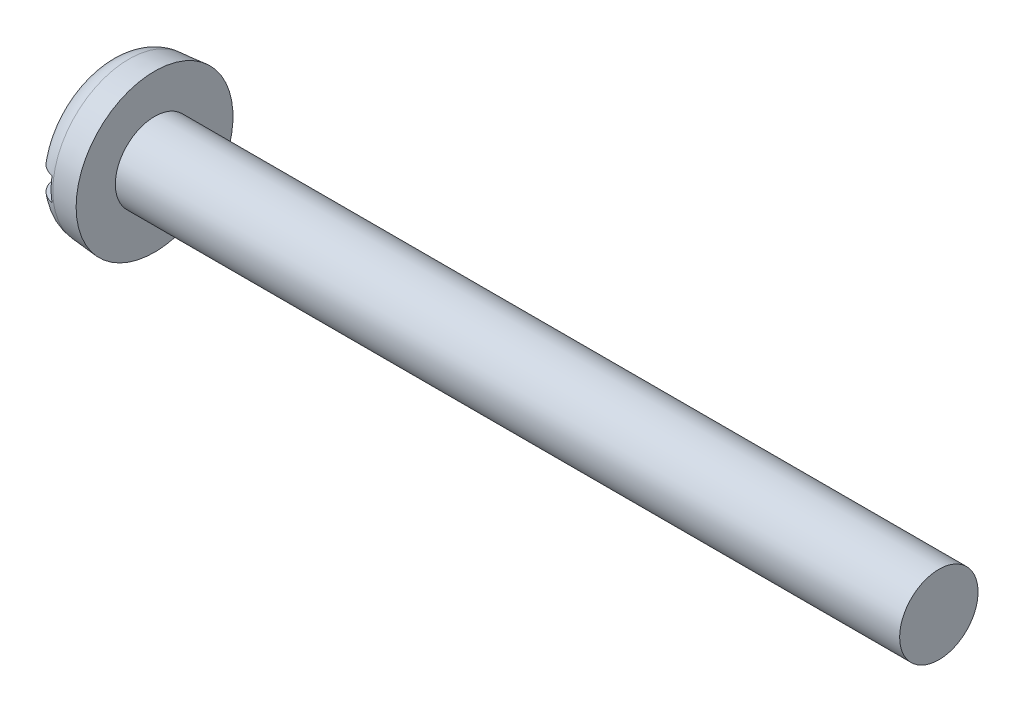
ISO-10303-21;
HEADER;
FILE_DESCRIPTION(('STEP AP214'),'2;1');
FILE_NAME('part.step','',(''),(''),'','','');
FILE_SCHEMA(('AUTOMOTIVE_DESIGN { 1 0 10303 214 1 1 1 1 }'));
ENDSEC;
DATA;
#1=APPLICATION_CONTEXT('core data for automotive mechanical design processes');
#2=APPLICATION_PROTOCOL_DEFINITION('international standard','automotive_design',2000,#1);
#3=PRODUCT_CONTEXT('',#1,'mechanical');
#4=PRODUCT('Part','Part','',(#3));
#5=PRODUCT_RELATED_PRODUCT_CATEGORY('part','',(#4));
#6=PRODUCT_DEFINITION_FORMATION('','',#4);
#7=PRODUCT_DEFINITION_CONTEXT('part definition',#1,'design');
#8=PRODUCT_DEFINITION('design','',#6,#7);
#9=PRODUCT_DEFINITION_SHAPE('','',#8);
#10=(LENGTH_UNIT() NAMED_UNIT(*) SI_UNIT(.MILLI.,.METRE.));
#11=(NAMED_UNIT(*) PLANE_ANGLE_UNIT() SI_UNIT($,.RADIAN.));
#12=(NAMED_UNIT(*) SI_UNIT($,.STERADIAN.) SOLID_ANGLE_UNIT());
#13=UNCERTAINTY_MEASURE_WITH_UNIT(LENGTH_MEASURE(1.E-05),#10,'distance_accuracy_value','');
#14=(GEOMETRIC_REPRESENTATION_CONTEXT(3) GLOBAL_UNCERTAINTY_ASSIGNED_CONTEXT((#13)) GLOBAL_UNIT_ASSIGNED_CONTEXT((#10,
#11,#12)) REPRESENTATION_CONTEXT('',''));
#15=CARTESIAN_POINT('',(0.,0.,0.));
#16=DIRECTION('',(0.,0.,1.));
#17=DIRECTION('',(1.,0.,0.));
#18=AXIS2_PLACEMENT_3D('',#15,#16,#17);
#19=CARTESIAN_POINT('',(0.,0.,0.));
#20=DIRECTION('',(-1.,0.,0.));
#21=DIRECTION('',(0.,0.,1.));
#22=AXIS2_PLACEMENT_3D('',#19,#20,#21);
#23=PLANE('',#22);
#24=DIRECTION('',(0.,0.,-1.));
#25=VECTOR('',#24,1.);
#26=CARTESIAN_POINT('',(0.,0.599999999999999,4.));
#27=LINE('',#26,#25);
#28=CARTESIAN_POINT('',(0.,0.599999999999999,2.62267277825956));
#29=VERTEX_POINT('',#28);
#30=CARTESIAN_POINT('',(0.,0.599999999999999,-2.62267277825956));
#31=VERTEX_POINT('',#30);
#32=EDGE_CURVE('E86',#29,#31,#27,.T.);
#33=ORIENTED_EDGE('',*,*,#32,.F.);
#34=CARTESIAN_POINT('',(0.,0.,0.));
#35=DIRECTION('',(-1.,0.,0.));
#36=DIRECTION('',(0.,0.,1.));
#37=AXIS2_PLACEMENT_3D('',#34,#35,#36);
#38=CIRCLE('',#37,2.69042979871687);
#39=EDGE_CURVE('E92',#29,#31,#38,.T.);
#40=ORIENTED_EDGE('',*,*,#39,.T.);
#41=EDGE_LOOP('',(#33,#40));
#42=FACE_BOUND('',#41,.T.);
#43=ADVANCED_FACE('F33',(#42),#23,.T.);
#44=CARTESIAN_POINT('',(-25.4,0.,0.));
#45=DIRECTION('',(-1.,0.,0.));
#46=DIRECTION('',(0.,0.,1.));
#47=AXIS2_PLACEMENT_3D('',#44,#45,#46);
#48=CYLINDRICAL_SURFACE('',#47,2.);
#49=CARTESIAN_POINT('',(42.4,0.,0.));
#50=DIRECTION('',(-1.,0.,0.));
#51=DIRECTION('',(0.,0.,1.));
#52=AXIS2_PLACEMENT_3D('',#49,#50,#51);
#53=CIRCLE('',#52,2.);
#54=CARTESIAN_POINT('',(42.4,0.,2.));
#55=VERTEX_POINT('',#54);
#56=EDGE_CURVE('E93',#55,#55,#53,.T.);
#57=ORIENTED_EDGE('',*,*,#56,.T.);
#58=EDGE_LOOP('',(#57));
#59=FACE_BOUND('',#58,.T.);
#60=CARTESIAN_POINT('',(2.4,0.,0.));
#61=DIRECTION('',(-1.,0.,0.));
#62=DIRECTION('',(0.,0.,1.));
#63=AXIS2_PLACEMENT_3D('',#60,#61,#62);
#64=CIRCLE('',#63,2.);
#65=CARTESIAN_POINT('',(2.4,0.,2.));
#66=VERTEX_POINT('',#65);
#67=EDGE_CURVE('E150',#66,#66,#64,.T.);
#68=ORIENTED_EDGE('',*,*,#67,.F.);
#69=EDGE_LOOP('',(#68));
#70=FACE_BOUND('',#69,.T.);
#71=ADVANCED_FACE('F138',(#59,#70),#48,.T.);
#72=CARTESIAN_POINT('',(42.4,2.,0.));
#73=DIRECTION('',(1.,0.,0.));
#74=DIRECTION('',(0.,0.,-1.));
#75=AXIS2_PLACEMENT_3D('',#72,#73,#74);
#76=PLANE('',#75);
#77=ORIENTED_EDGE('',*,*,#56,.F.);
#78=EDGE_LOOP('',(#77));
#79=FACE_BOUND('',#78,.T.);
#80=ADVANCED_FACE('F136',(#79),#76,.T.);
#81=DIRECTION('',(0.,0.,1.));
#82=VECTOR('',#81,1.);
#83=CARTESIAN_POINT('',(0.,-0.599999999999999,-4.));
#84=LINE('',#83,#82);
#85=CARTESIAN_POINT('',(0.,-0.6,-2.62267277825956));
#86=VERTEX_POINT('',#85);
#87=CARTESIAN_POINT('',(0.,-0.6,2.62267277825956));
#88=VERTEX_POINT('',#87);
#89=EDGE_CURVE('E77',#86,#88,#84,.T.);
#90=ORIENTED_EDGE('',*,*,#89,.F.);
#91=EDGE_CURVE('E84',#86,#88,#38,.T.);
#92=ORIENTED_EDGE('',*,*,#91,.T.);
#93=EDGE_LOOP('',(#90,#92));
#94=FACE_BOUND('',#93,.T.);
#95=ADVANCED_FACE('F83',(#94),#23,.T.);
#96=CARTESIAN_POINT('',(0.,0.,0.));
#97=DIRECTION('',(1.,0.,0.));
#98=DIRECTION('',(0.,0.,-1.));
#99=AXIS2_PLACEMENT_3D('',#96,#97,#98);
#100=CONICAL_SURFACE('',#99,3.79002720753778,0.0872664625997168);
#101=CARTESIAN_POINT('',(1.09541310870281,0.,0.));
#102=DIRECTION('',(-1.,0.,0.));
#103=DIRECTION('',(0.,0.,1.));
#104=AXIS2_PLACEMENT_3D('',#101,#102,#103);
#105=CIRCLE('',#104,3.88586343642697);
#106=CARTESIAN_POINT('',(1.09541310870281,0.,3.88586343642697));
#107=VERTEX_POINT('',#106);
#108=EDGE_CURVE('E96',#107,#107,#105,.F.);
#109=ORIENTED_EDGE('',*,*,#108,.T.);
#110=EDGE_LOOP('',(#109));
#111=FACE_BOUND('',#110,.T.);
#112=CARTESIAN_POINT('',(2.4,0.,0.));
#113=DIRECTION('',(-1.,0.,0.));
#114=DIRECTION('',(0.,0.,1.));
#115=AXIS2_PLACEMENT_3D('',#112,#113,#114);
#116=CIRCLE('',#115,4.);
#117=CARTESIAN_POINT('',(2.4,0.,4.));
#118=VERTEX_POINT('',#117);
#119=EDGE_CURVE('E98',#118,#118,#116,.T.);
#120=ORIENTED_EDGE('',*,*,#119,.T.);
#121=EDGE_LOOP('',(#120));
#122=FACE_BOUND('',#121,.T.);
#123=ADVANCED_FACE('F129',(#111,#122),#100,.T.);
#124=CARTESIAN_POINT('',(2.4,2.,0.));
#125=DIRECTION('',(-1.,0.,0.));
#126=DIRECTION('',(0.,0.,1.));
#127=AXIS2_PLACEMENT_3D('',#124,#125,#126);
#128=PLANE('',#127);
#129=ORIENTED_EDGE('',*,*,#119,.F.);
#130=EDGE_LOOP('',(#129));
#131=FACE_BOUND('',#130,.T.);
#132=ORIENTED_EDGE('',*,*,#67,.T.);
#133=EDGE_LOOP('',(#132));
#134=FACE_BOUND('',#133,.T.);
#135=ADVANCED_FACE('F125',(#131,#134),#128,.F.);
#136=CARTESIAN_POINT('',(1.2,0.,0.));
#137=DIRECTION('',(-1.,0.,0.));
#138=DIRECTION('',(0.,0.,1.));
#139=AXIS2_PLACEMENT_3D('',#136,#137,#138);
#140=TOROIDAL_SURFACE('',#139,2.69042979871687,1.2);
#141=CARTESIAN_POINT('',(0.3865043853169,0.599999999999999,-3.52185650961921));
#142=CARTESIAN_POINT('',(0.435468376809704,0.599999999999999,-3.56765543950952));
#143=CARTESIAN_POINT('',(0.48830443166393,0.599999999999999,-3.60938194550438));
#144=CARTESIAN_POINT('',(0.600265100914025,0.599999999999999,-3.68342203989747));
#145=CARTESIAN_POINT('',(0.659396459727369,0.599999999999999,-3.71572539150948));
#146=CARTESIAN_POINT('',(0.782252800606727,0.599999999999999,-3.76991557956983));
#147=CARTESIAN_POINT('',(0.845977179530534,0.599999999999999,-3.79180378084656));
#148=CARTESIAN_POINT('',(0.976191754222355,0.599999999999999,-3.82450279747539));
#149=CARTESIAN_POINT('',(1.04268130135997,0.599999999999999,-3.83531619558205));
#150=CARTESIAN_POINT('',(1.1761990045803,0.599999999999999,-3.84552483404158));
#151=CARTESIAN_POINT('',(1.2432228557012,0.599999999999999,-3.84497642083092));
#152=CARTESIAN_POINT('',(1.37622462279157,0.599999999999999,-3.83261582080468));
#153=CARTESIAN_POINT('',(1.44220252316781,0.599999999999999,-3.82080346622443));
#154=CARTESIAN_POINT('',(1.57113854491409,0.599999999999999,-3.7862937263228));
#155=CARTESIAN_POINT('',(1.63410108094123,0.599999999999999,-3.76361282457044));
#156=CARTESIAN_POINT('',(1.75534617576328,0.599999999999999,-3.70804459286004));
#157=CARTESIAN_POINT('',(1.81362870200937,0.599999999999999,-3.67515719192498));
#158=CARTESIAN_POINT('',(1.92413366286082,0.599999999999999,-3.5999836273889));
#159=CARTESIAN_POINT('',(1.97632984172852,0.599999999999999,-3.55765888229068));
#160=CARTESIAN_POINT('',(2.07296076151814,0.599999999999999,-3.46492588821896));
#161=CARTESIAN_POINT('',(2.11739523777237,0.599999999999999,-3.4145173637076));
#162=CARTESIAN_POINT('',(2.19773705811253,0.599999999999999,-3.30652404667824));
#163=CARTESIAN_POINT('',(2.2335546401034,0.599999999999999,-3.24887250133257));
#164=CARTESIAN_POINT('',(2.29517588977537,0.599999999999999,-3.12844912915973));
#165=CARTESIAN_POINT('',(2.32097889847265,0.599999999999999,-3.06567696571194));
#166=CARTESIAN_POINT('',(2.36230436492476,0.599999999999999,-2.93572304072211));
#167=CARTESIAN_POINT('',(2.37765465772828,0.599999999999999,-2.86848656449));
#168=CARTESIAN_POINT('',(2.39710654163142,0.599999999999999,-2.73240889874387));
#169=CARTESIAN_POINT('',(2.40120699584,0.599999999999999,-2.66356754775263));
#170=CARTESIAN_POINT('',(2.39814758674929,0.599999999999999,-2.52464946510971));
#171=CARTESIAN_POINT('',(2.39074269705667,0.599999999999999,-2.45457815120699));
#172=CARTESIAN_POINT('',(2.36454808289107,0.599999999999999,-2.31659764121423));
#173=CARTESIAN_POINT('',(2.34575688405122,0.599999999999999,-2.24868872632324));
#174=CARTESIAN_POINT('',(2.29682890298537,0.599999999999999,-2.11531585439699));
#175=CARTESIAN_POINT('',(2.26644200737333,0.599999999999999,-2.04994358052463));
#176=CARTESIAN_POINT('',(2.19524076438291,0.599999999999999,-1.92513363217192));
#177=CARTESIAN_POINT('',(2.15442449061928,0.599999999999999,-1.86569705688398));
#178=CARTESIAN_POINT('',(2.06294283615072,0.599999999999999,-1.75389115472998));
#179=CARTESIAN_POINT('',(2.01217853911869,0.599999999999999,-1.70160258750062));
#180=CARTESIAN_POINT('',(1.90235992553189,0.599999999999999,-1.60657192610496));
#181=CARTESIAN_POINT('',(1.84330597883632,0.599999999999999,-1.56382940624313));
#182=CARTESIAN_POINT('',(1.72028944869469,0.599999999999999,-1.49071034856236));
#183=CARTESIAN_POINT('',(1.65652070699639,0.599999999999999,-1.46000898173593));
#184=CARTESIAN_POINT('',(1.52445964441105,0.599999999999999,-1.41076217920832));
#185=CARTESIAN_POINT('',(1.45617085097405,0.599999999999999,-1.39220738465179));
#186=CARTESIAN_POINT('',(1.32258878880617,0.599999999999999,-1.3692588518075));
#187=CARTESIAN_POINT('',(1.25746124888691,0.599999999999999,-1.36389765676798));
#188=CARTESIAN_POINT('',(1.12729576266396,0.599999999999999,-1.36480396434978));
#189=CARTESIAN_POINT('',(1.06225779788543,0.599999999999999,-1.37106853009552));
#190=CARTESIAN_POINT('',(0.937361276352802,0.599999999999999,-1.39427975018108));
#191=CARTESIAN_POINT('',(0.877403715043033,0.599999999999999,-1.41070181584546));
#192=CARTESIAN_POINT('',(0.760914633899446,0.599999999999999,-1.45296891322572));
#193=CARTESIAN_POINT('',(0.704383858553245,0.599999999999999,-1.47881598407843));
#194=CARTESIAN_POINT('',(0.59370506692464,0.599999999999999,-1.54020998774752));
#195=CARTESIAN_POINT('',(0.539760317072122,0.599999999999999,-1.57612236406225));
#196=CARTESIAN_POINT('',(0.438104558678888,0.599999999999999,-1.65588570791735));
#197=CARTESIAN_POINT('',(0.390395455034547,0.599999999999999,-1.69973909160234));
#198=CARTESIAN_POINT('',(0.298820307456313,0.599999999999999,-1.79776253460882));
#199=CARTESIAN_POINT('',(0.255521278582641,0.599999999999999,-1.85246315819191));
#200=CARTESIAN_POINT('',(0.178283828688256,0.599999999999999,-1.96812037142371));
#201=CARTESIAN_POINT('',(0.144347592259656,0.599999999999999,-2.02907841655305));
#202=CARTESIAN_POINT('',(0.0855336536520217,0.599999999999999,-2.15824220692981));
#203=CARTESIAN_POINT('',(0.0610804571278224,0.599999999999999,-2.22664188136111));
#204=CARTESIAN_POINT('',(0.0240295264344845,0.599999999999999,-2.36658228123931));
#205=CARTESIAN_POINT('',(0.0114315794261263,0.599999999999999,-2.43812295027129));
#206=CARTESIAN_POINT('',(-0.00140349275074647,0.599999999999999,-2.58214276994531));
#207=CARTESIAN_POINT('',(-0.00166960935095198,0.599999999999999,-2.65461931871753));
#208=CARTESIAN_POINT('',(0.0102529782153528,0.599999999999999,-2.79856484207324));
#209=CARTESIAN_POINT('',(0.0224436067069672,0.599999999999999,-2.87003365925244));
#210=CARTESIAN_POINT('',(0.0586721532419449,0.599999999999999,-3.00828260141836));
#211=CARTESIAN_POINT('',(0.082454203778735,0.599999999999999,-3.07512990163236));
#212=CARTESIAN_POINT('',(0.141152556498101,0.599999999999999,-3.20367573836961));
#213=CARTESIAN_POINT('',(0.176053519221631,0.599999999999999,-3.26538122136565));
#214=CARTESIAN_POINT('',(0.240740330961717,0.599999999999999,-3.35956174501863));
#215=CARTESIAN_POINT('',(0.267410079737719,0.599999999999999,-3.39421743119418));
#216=CARTESIAN_POINT('',(0.324340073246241,0.599999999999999,-3.46044388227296));
#217=CARTESIAN_POINT('',(0.354600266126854,0.599999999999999,-3.49201469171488));
#218=CARTESIAN_POINT('',(0.3865043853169,0.599999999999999,-3.52185650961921));
#219=B_SPLINE_CURVE_WITH_KNOTS('',3,(#141,#142,#143,#144,#145,#146,#147,#148,#149,#150,#151,
#152,#153,#154,#155,#156,#157,#158,#159,#160,#161,#162,#163,#164,#165,#166,#167,#168,#169,#170,
#171,#172,#173,#174,#175,#176,#177,#178,#179,#180,#181,#182,#183,#184,#185,#186,#187,#188,#189,
#190,#191,#192,#193,#194,#195,#196,#197,#198,#199,#200,#201,#202,#203,#204,#205,#206,#207,#208,
#209,#210,#211,#212,#213,#214,#215,#216,#217,#218),.UNSPECIFIED.,.T.,.F.,(4,2,2,2,2,2,2,2,2,2,2,
2,2,2,2,2,2,2,2,2,2,2,2,2,2,2,2,2,2,2,2,2,2,2,2,2,2,2,4),(0.,0.200976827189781,
0.402171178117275,0.603339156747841,0.804460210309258,1.0045840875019,1.2047109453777,
1.40453524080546,1.60436092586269,1.80501901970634,2.00568395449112,2.2083565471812,
2.41104247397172,2.61699090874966,2.82296015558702,3.03337636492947,3.24381982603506,
3.45908552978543,3.67439102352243,3.8919572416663,4.10951375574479,4.32071351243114,
4.53175034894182,4.72677835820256,4.92175710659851,5.10742155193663,5.29312619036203,
5.48672044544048,5.68037370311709,5.88873369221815,6.09714225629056,6.31402614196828,
6.53090613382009,6.74727622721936,6.96367975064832,7.17550906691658,7.38704740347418,
7.51800243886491,7.64895558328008),.UNSPECIFIED.);
#220=CARTESIAN_POINT('',(1.,0.599999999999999,-3.8268957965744));
#221=VERTEX_POINT('',#220);
#222=EDGE_CURVE('E11',#31,#221,#219,.T.);
#223=ORIENTED_EDGE('',*,*,#222,.F.);
#224=ORIENTED_EDGE('',*,*,#39,.F.);
#225=CARTESIAN_POINT('',(0.568676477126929,0.599999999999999,1.55841219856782));
#226=CARTESIAN_POINT('',(0.622454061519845,0.599999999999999,1.52276443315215));
#227=CARTESIAN_POINT('',(0.679085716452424,0.599999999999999,1.49137245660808));
#228=CARTESIAN_POINT('',(0.796770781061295,0.599999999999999,1.43831139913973));
#229=CARTESIAN_POINT('',(0.857825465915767,0.599999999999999,1.41664513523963));
#230=CARTESIAN_POINT('',(0.982921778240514,0.599999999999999,1.38402811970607));
#231=CARTESIAN_POINT('',(1.04697051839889,0.599999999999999,1.37310440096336));
#232=CARTESIAN_POINT('',(1.17597937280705,0.599999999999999,1.36268675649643));
#233=CARTESIAN_POINT('',(1.24093916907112,0.599999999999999,1.36318893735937));
#234=CARTESIAN_POINT('',(1.36722529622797,0.599999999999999,1.37533615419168));
#235=CARTESIAN_POINT('',(1.42859438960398,0.599999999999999,1.38654477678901));
#236=CARTESIAN_POINT('',(1.54865022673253,0.599999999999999,1.41889802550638));
#237=CARTESIAN_POINT('',(1.60733638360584,0.599999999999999,1.44004481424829));
#238=CARTESIAN_POINT('',(1.72180457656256,0.599999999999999,1.49189888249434));
#239=CARTESIAN_POINT('',(1.77749881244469,0.599999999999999,1.52279911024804));
#240=CARTESIAN_POINT('',(1.88340638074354,0.599999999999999,1.59287167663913));
#241=CARTESIAN_POINT('',(1.93361816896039,0.599999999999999,1.63204633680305));
#242=CARTESIAN_POINT('',(2.03113053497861,0.599999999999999,1.7207614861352));
#243=CARTESIAN_POINT('',(2.07792119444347,0.599999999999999,1.77086293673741));
#244=CARTESIAN_POINT('',(2.16295007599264,0.599999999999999,1.87786529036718));
#245=CARTESIAN_POINT('',(2.20118595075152,0.599999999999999,1.93476805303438));
#246=CARTESIAN_POINT('',(2.26997158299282,0.599999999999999,2.05705672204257));
#247=CARTESIAN_POINT('',(2.30000838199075,0.599999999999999,2.12273201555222));
#248=CARTESIAN_POINT('',(2.34872218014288,0.599999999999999,2.25817360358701));
#249=CARTESIAN_POINT('',(2.36739836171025,0.599999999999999,2.32794019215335));
#250=CARTESIAN_POINT('',(2.39284815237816,0.599999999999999,2.47012141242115));
#251=CARTESIAN_POINT('',(2.3995382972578,0.599999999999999,2.54255105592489));
#252=CARTESIAN_POINT('',(2.40041533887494,0.599999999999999,2.68749005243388));
#253=CARTESIAN_POINT('',(2.39460324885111,0.599999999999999,2.75999939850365));
#254=CARTESIAN_POINT('',(2.37072428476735,0.599999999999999,2.90156578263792));
#255=CARTESIAN_POINT('',(2.35289092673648,0.599999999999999,2.97066215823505));
#256=CARTESIAN_POINT('',(2.3055955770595,0.599999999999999,3.10475609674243));
#257=CARTESIAN_POINT('',(2.2761350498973,0.599999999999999,3.16975417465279));
#258=CARTESIAN_POINT('',(2.20718370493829,0.599999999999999,3.29217559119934));
#259=CARTESIAN_POINT('',(2.16794580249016,0.599999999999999,3.34974141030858));
#260=CARTESIAN_POINT('',(2.08018656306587,0.599999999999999,3.45730019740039));
#261=CARTESIAN_POINT('',(2.03166624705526,0.599999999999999,3.50729399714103));
#262=CARTESIAN_POINT('',(1.92773605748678,0.599999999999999,3.59728886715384));
#263=CARTESIAN_POINT('',(1.87247613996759,0.599999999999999,3.63746317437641));
#264=CARTESIAN_POINT('',(1.75592540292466,0.599999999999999,3.70782235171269));
#265=CARTESIAN_POINT('',(1.69463504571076,0.599999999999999,3.73800798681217));
#266=CARTESIAN_POINT('',(1.5686108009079,0.599999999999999,3.78714975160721));
#267=CARTESIAN_POINT('',(1.50393088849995,0.599999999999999,3.80624437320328));
#268=CARTESIAN_POINT('',(1.37227430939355,0.599999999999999,3.83322369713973));
#269=CARTESIAN_POINT('',(1.30529774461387,0.599999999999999,3.84110889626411));
#270=CARTESIAN_POINT('',(1.17141837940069,0.599999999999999,3.845417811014));
#271=CARTESIAN_POINT('',(1.10451797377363,0.599999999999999,3.841916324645));
#272=CARTESIAN_POINT('',(0.972258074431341,0.599999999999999,3.82372114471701));
#273=CARTESIAN_POINT('',(0.906898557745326,0.599999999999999,3.80902761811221));
#274=CARTESIAN_POINT('',(0.779620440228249,0.599999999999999,3.76890152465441));
#275=CARTESIAN_POINT('',(0.717699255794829,0.599999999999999,3.74347714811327));
#276=CARTESIAN_POINT('',(0.598976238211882,0.599999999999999,3.68264222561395));
#277=CARTESIAN_POINT('',(0.542174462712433,0.599999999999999,3.64723156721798));
#278=CARTESIAN_POINT('',(0.434989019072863,0.599999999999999,3.56726339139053));
#279=CARTESIAN_POINT('',(0.384638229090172,0.599999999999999,3.5226618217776));
#280=CARTESIAN_POINT('',(0.292043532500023,0.599999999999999,3.42571932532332));
#281=CARTESIAN_POINT('',(0.249799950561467,0.599999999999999,3.37337808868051));
#282=CARTESIAN_POINT('',(0.174110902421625,0.599999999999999,3.26185326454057));
#283=CARTESIAN_POINT('',(0.140765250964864,0.599999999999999,3.20260196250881));
#284=CARTESIAN_POINT('',(0.0843091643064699,0.599999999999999,3.07941230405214));
#285=CARTESIAN_POINT('',(0.0611994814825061,0.599999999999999,3.01547360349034));
#286=CARTESIAN_POINT('',(0.0254327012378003,0.599999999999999,2.88357716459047));
#287=CARTESIAN_POINT('',(0.0129588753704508,0.599999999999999,2.81556976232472));
#288=CARTESIAN_POINT('',(-0.000658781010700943,0.599999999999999,2.67843562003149));
#289=CARTESIAN_POINT('',(-0.00180186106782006,0.599999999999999,2.60930880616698));
#290=CARTESIAN_POINT('',(0.00723867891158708,0.599999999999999,2.47027110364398));
#291=CARTESIAN_POINT('',(0.0176724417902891,0.599999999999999,2.40037650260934));
#292=CARTESIAN_POINT('',(0.0498636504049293,0.599999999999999,2.2632278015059));
#293=CARTESIAN_POINT('',(0.0716251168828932,0.599999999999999,2.19597464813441));
#294=CARTESIAN_POINT('',(0.126425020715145,0.599999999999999,2.06442921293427));
#295=CARTESIAN_POINT('',(0.159709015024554,0.599999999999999,2.00023925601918));
#296=CARTESIAN_POINT('',(0.236484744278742,0.599999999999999,1.87833288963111));
#297=CARTESIAN_POINT('',(0.279968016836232,0.599999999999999,1.82061117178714));
#298=CARTESIAN_POINT('',(0.363480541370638,0.599999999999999,1.7273106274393));
#299=CARTESIAN_POINT('',(0.401461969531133,0.599999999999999,1.68987927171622));
#300=CARTESIAN_POINT('',(0.481873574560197,0.599999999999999,1.62013708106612));
#301=CARTESIAN_POINT('',(0.524303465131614,0.599999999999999,1.58782591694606));
#302=CARTESIAN_POINT('',(0.568676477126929,0.599999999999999,1.55841219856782));
#303=B_SPLINE_CURVE_WITH_KNOTS('',3,(#225,#226,#227,#228,#229,#230,#231,#232,#233,#234,#235,
#236,#237,#238,#239,#240,#241,#242,#243,#244,#245,#246,#247,#248,#249,#250,#251,#252,#253,#254,
#255,#256,#257,#258,#259,#260,#261,#262,#263,#264,#265,#266,#267,#268,#269,#270,#271,#272,#273,
#274,#275,#276,#277,#278,#279,#280,#281,#282,#283,#284,#285,#286,#287,#288,#289,#290,#291,#292,
#293,#294,#295,#296,#297,#298,#299,#300,#301,#302),.UNSPECIFIED.,.T.,.F.,(4,2,2,2,2,2,2,2,2,2,2,
2,2,2,2,2,2,2,2,2,2,2,2,2,2,2,2,2,2,2,2,2,2,2,2,2,2,2,4),(0.,0.193385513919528,
0.386827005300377,0.580754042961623,0.774615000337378,0.960896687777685,1.14721893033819,
1.33748625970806,1.52780704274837,1.73256769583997,1.93738446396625,2.15302491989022,
2.3686808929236,2.58583282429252,2.80296715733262,3.01600070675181,3.22900743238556,
3.43699107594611,3.64495185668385,3.84892478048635,4.05288207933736,4.25423457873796,
4.45557815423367,4.65560180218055,4.85562246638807,5.05549074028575,5.25536126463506,
5.45621303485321,5.6570728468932,5.86009921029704,6.06314049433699,6.26961358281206,
6.47610034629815,6.68713711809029,6.89824884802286,7.11416888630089,7.3299104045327,
7.4894871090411,7.64905354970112),.UNSPECIFIED.);
#304=CARTESIAN_POINT('',(1.,0.599999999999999,3.8268957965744));
#305=VERTEX_POINT('',#304);
#306=EDGE_CURVE('E110',#305,#29,#303,.T.);
#307=ORIENTED_EDGE('',*,*,#306,.F.);
#308=CARTESIAN_POINT('',(1.,0.,0.));
#309=DIRECTION('',(-1.,0.,0.));
#310=DIRECTION('',(0.,0.,1.));
#311=AXIS2_PLACEMENT_3D('',#308,#309,#310);
#312=CIRCLE('',#311,3.8736457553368);
#313=CARTESIAN_POINT('',(1.,-0.600000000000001,3.8268957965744));
#314=VERTEX_POINT('',#313);
#315=EDGE_CURVE('E104',#305,#314,#312,.F.);
#316=ORIENTED_EDGE('',*,*,#315,.T.);
#317=CARTESIAN_POINT('',(0.568676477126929,-0.6,1.55841219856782));
#318=CARTESIAN_POINT('',(0.509332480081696,-0.6,1.59775463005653));
#319=CARTESIAN_POINT('',(0.453379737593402,-0.6,1.64234041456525));
#320=CARTESIAN_POINT('',(0.349719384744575,-0.6,1.74035526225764));
#321=CARTESIAN_POINT('',(0.302029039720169,-0.6,1.79380239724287));
#322=CARTESIAN_POINT('',(0.216237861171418,-0.6,1.90774469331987));
#323=CARTESIAN_POINT('',(0.178118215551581,-0.6,1.96822568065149));
#324=CARTESIAN_POINT('',(0.112363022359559,-0.6,2.0946004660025));
#325=CARTESIAN_POINT('',(0.0847225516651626,-0.6,2.16049170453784));
#326=CARTESIAN_POINT('',(0.0402688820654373,-0.6,2.29725613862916));
#327=CARTESIAN_POINT('',(0.0236758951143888,-0.6,2.36820113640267));
#328=CARTESIAN_POINT('',(0.00278349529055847,-0.6,2.51189141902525));
#329=CARTESIAN_POINT('',(-0.00151505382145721,-0.6,2.58463683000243));
#330=CARTESIAN_POINT('',(0.00243750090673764,-0.6,2.72894600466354));
#331=CARTESIAN_POINT('',(0.010543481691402,-0.6,2.80051368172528));
#332=CARTESIAN_POINT('',(0.0389520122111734,-0.6,2.94118836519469));
#333=CARTESIAN_POINT('',(0.0592529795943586,-0.6,3.01029568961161));
#334=CARTESIAN_POINT('',(0.110960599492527,-0.6,3.1423581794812));
#335=CARTESIAN_POINT('',(0.142096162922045,-0.6,3.20541948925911));
#336=CARTESIAN_POINT('',(0.214736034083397,-0.6,3.32525905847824));
#337=CARTESIAN_POINT('',(0.256239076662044,-0.6,3.38203808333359));
#338=CARTESIAN_POINT('',(0.347460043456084,-0.6,3.48641848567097));
#339=CARTESIAN_POINT('',(0.396982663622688,-0.6,3.53419059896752));
#340=CARTESIAN_POINT('',(0.503454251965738,-0.6,3.62058393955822));
#341=CARTESIAN_POINT('',(0.560402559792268,-0.600000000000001,3.6592059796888));
#342=CARTESIAN_POINT('',(0.67915616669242,-0.600000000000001,3.72559524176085));
#343=CARTESIAN_POINT('',(0.740873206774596,-0.600000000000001,3.75352040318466));
#344=CARTESIAN_POINT('',(0.868147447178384,-0.600000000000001,3.79850563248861));
#345=CARTESIAN_POINT('',(0.933704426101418,-0.600000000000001,3.81556632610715));
#346=CARTESIAN_POINT('',(1.06616217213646,-0.600000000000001,3.83820251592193));
#347=CARTESIAN_POINT('',(1.13304550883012,-0.600000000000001,3.84388011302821));
#348=CARTESIAN_POINT('',(1.26681198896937,-0.600000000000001,3.84388783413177));
#349=CARTESIAN_POINT('',(1.33369513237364,-0.600000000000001,3.83821825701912));
#350=CARTESIAN_POINT('',(1.46534857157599,-0.600000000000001,3.81573676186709));
#351=CARTESIAN_POINT('',(1.5301247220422,-0.600000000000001,3.79895909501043));
#352=CARTESIAN_POINT('',(1.65595122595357,-0.600000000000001,3.75479405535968));
#353=CARTESIAN_POINT('',(1.7170015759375,-0.600000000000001,3.72740667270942));
#354=CARTESIAN_POINT('',(1.83382644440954,-0.600000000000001,3.66274505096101));
#355=CARTESIAN_POINT('',(1.88958679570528,-0.6,3.62544522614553));
#356=CARTESIAN_POINT('',(1.99411858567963,-0.6,3.54208564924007));
#357=CARTESIAN_POINT('',(2.04288982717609,-0.6,3.49602565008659));
#358=CARTESIAN_POINT('',(2.1325144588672,-0.6,3.39605796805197));
#359=CARTESIAN_POINT('',(2.17329813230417,-0.6,3.34208780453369));
#360=CARTESIAN_POINT('',(2.245373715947,-0.6,3.22814724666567));
#361=CARTESIAN_POINT('',(2.27666509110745,-0.6,3.16817651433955));
#362=CARTESIAN_POINT('',(2.32937247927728,-0.6,3.04302336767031));
#363=CARTESIAN_POINT('',(2.35063955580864,-0.6,2.97777826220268));
#364=CARTESIAN_POINT('',(2.3821555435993,-0.6,2.84468257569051));
#365=CARTESIAN_POINT('',(2.39240345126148,-0.6,2.77683175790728));
#366=CARTESIAN_POINT('',(2.40182781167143,-0.6,2.6389851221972));
#367=CARTESIAN_POINT('',(2.40077563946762,-0.6,2.56897370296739));
#368=CARTESIAN_POINT('',(2.38721389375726,-0.6,2.43007140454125));
#369=CARTESIAN_POINT('',(2.37470291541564,-0.6,2.36118066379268));
#370=CARTESIAN_POINT('',(2.33824897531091,-0.6,2.22476443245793));
#371=CARTESIAN_POINT('',(2.31404566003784,-0.6,2.15730848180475));
#372=CARTESIAN_POINT('',(2.25484108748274,-0.6,2.02730649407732));
#373=CARTESIAN_POINT('',(2.21983804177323,-0.6,1.96476127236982));
#374=CARTESIAN_POINT('',(2.13932874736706,-0.6,1.8453529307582));
#375=CARTESIAN_POINT('',(2.09366234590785,-0.6,1.78859760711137));
#376=CARTESIAN_POINT('',(1.99331431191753,-0.6,1.68367587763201));
#377=CARTESIAN_POINT('',(1.93863170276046,-0.6,1.63551040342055));
#378=CARTESIAN_POINT('',(1.82254625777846,-0.6,1.55016942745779));
#379=CARTESIAN_POINT('',(1.7612597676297,-0.6,1.51283623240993));
#380=CARTESIAN_POINT('',(1.6329601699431,-0.6,1.44984263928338));
#381=CARTESIAN_POINT('',(1.56595104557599,-0.6,1.42417419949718));
#382=CARTESIAN_POINT('',(1.43290073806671,-0.6,1.38720166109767));
#383=CARTESIAN_POINT('',(1.36709528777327,-0.6,1.37505067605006));
#384=CARTESIAN_POINT('',(1.23436273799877,-0.6,1.3628486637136));
#385=CARTESIAN_POINT('',(1.16743586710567,-0.6,1.36279519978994));
#386=CARTESIAN_POINT('',(1.03904581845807,-0.6,1.37438428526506));
#387=CARTESIAN_POINT('',(0.97751125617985,-0.6,1.38526326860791));
#388=CARTESIAN_POINT('',(0.857136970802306,-0.6,1.41700902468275));
#389=CARTESIAN_POINT('',(0.79829431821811,-0.6,1.43786464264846));
#390=CARTESIAN_POINT('',(0.711456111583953,-0.6,1.47666141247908));
#391=CARTESIAN_POINT('',(0.681965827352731,-0.6,1.49136190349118));
#392=CARTESIAN_POINT('',(0.624300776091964,-0.6,1.52313858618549));
#393=CARTESIAN_POINT('',(0.596125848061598,-0.6,1.54021448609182));
#394=CARTESIAN_POINT('',(0.568676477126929,-0.6,1.55841219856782));
#395=B_SPLINE_CURVE_WITH_KNOTS('',3,(#317,#318,#319,#320,#321,#322,#323,#324,#325,#326,#327,
#328,#329,#330,#331,#332,#333,#334,#335,#336,#337,#338,#339,#340,#341,#342,#343,#344,#345,#346,
#347,#348,#349,#350,#351,#352,#353,#354,#355,#356,#357,#358,#359,#360,#361,#362,#363,#364,#365,
#366,#367,#368,#369,#370,#371,#372,#373,#374,#375,#376,#377,#378,#379,#380,#381,#382,#383,#384,
#385,#386,#387,#388,#389,#390,#391,#392,#393,#394),.UNSPECIFIED.,.T.,.F.,(4,2,2,2,2,2,2,2,2,2,2,
2,2,2,2,2,2,2,2,2,2,2,2,2,2,2,2,2,2,2,2,2,2,2,2,2,2,2,4),(0.,0.2134759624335,0.427392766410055,
0.640885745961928,0.854278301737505,1.07180637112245,1.28934972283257,1.50436737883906,
1.71935714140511,1.92931435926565,2.13924596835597,2.34467456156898,2.55008489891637,
2.75233330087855,2.95457005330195,3.15498457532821,3.355393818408,3.55518797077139,
3.75498230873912,3.95529744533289,4.15561823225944,4.35761633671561,4.55962582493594,
4.76454879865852,4.96949043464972,5.17858616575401,5.38770753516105,5.60171647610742,
5.815760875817,6.03325422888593,6.25077115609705,6.46494128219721,6.67896353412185,
6.87865214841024,7.07830054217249,7.26491113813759,7.4513135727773,7.55006829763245,
7.64881090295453),.UNSPECIFIED.);
#396=EDGE_CURVE('E91',#88,#314,#395,.T.);
#397=ORIENTED_EDGE('',*,*,#396,.F.);
#398=ORIENTED_EDGE('',*,*,#91,.F.);
#399=CARTESIAN_POINT('',(0.3865043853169,-0.6,-3.52185650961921));
#400=CARTESIAN_POINT('',(0.336558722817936,-0.6,-3.47513075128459));
#401=CARTESIAN_POINT('',(0.290567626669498,-0.6,-3.42409544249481));
#402=CARTESIAN_POINT('',(0.207816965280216,-0.6,-3.31495007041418));
#403=CARTESIAN_POINT('',(0.171070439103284,-0.6,-3.2568301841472));
#404=CARTESIAN_POINT('',(0.107859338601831,-0.6,-3.13533662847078));
#405=CARTESIAN_POINT('',(0.081381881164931,-0.6,-3.07196966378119));
#406=CARTESIAN_POINT('',(0.0392838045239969,-0.6,-2.94175448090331));
#407=CARTESIAN_POINT('',(0.0236604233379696,-0.6,-2.87490715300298));
#408=CARTESIAN_POINT('',(0.00341113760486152,-0.6,-2.73858284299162));
#409=CARTESIAN_POINT('',(-0.00105268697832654,-0.6,-2.66908182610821));
#410=CARTESIAN_POINT('',(0.00147102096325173,-0.6,-2.53028718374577));
#411=CARTESIAN_POINT('',(0.00846038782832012,-0.6,-2.46099359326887));
#412=CARTESIAN_POINT('',(0.0338721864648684,-0.6,-2.3228723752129));
#413=CARTESIAN_POINT('',(0.052556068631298,-0.6,-2.25409284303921));
#414=CARTESIAN_POINT('',(0.100979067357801,-0.6,-2.12053875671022));
#415=CARTESIAN_POINT('',(0.13071979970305,-0.6,-2.05576478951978));
#416=CARTESIAN_POINT('',(0.201105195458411,-0.6,-1.93075930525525));
#417=CARTESIAN_POINT('',(0.241951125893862,-0.6,-1.87064095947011));
#418=CARTESIAN_POINT('',(0.333200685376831,-0.6,-1.75812796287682));
#419=CARTESIAN_POINT('',(0.383605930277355,-0.6,-1.70573462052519));
#420=CARTESIAN_POINT('',(0.49243046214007,-0.6,-1.61063718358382));
#421=CARTESIAN_POINT('',(0.550808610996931,-0.6,-1.5678861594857));
#422=CARTESIAN_POINT('',(0.674249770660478,-0.6,-1.49345451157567));
#423=CARTESIAN_POINT('',(0.739309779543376,-0.6,-1.46176894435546));
#424=CARTESIAN_POINT('',(0.870462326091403,-0.6,-1.41247032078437));
#425=CARTESIAN_POINT('',(0.936297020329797,-0.6,-1.39417366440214));
#426=CARTESIAN_POINT('',(1.0701878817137,-0.6,-1.36992148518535));
#427=CARTESIAN_POINT('',(1.13824253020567,-0.6,-1.36395769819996));
#428=CARTESIAN_POINT('',(1.26912997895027,-0.6,-1.36469761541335));
#429=CARTESIAN_POINT('',(1.33196990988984,-0.6,-1.37048080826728));
#430=CARTESIAN_POINT('',(1.45576558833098,-0.6,-1.39257493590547));
#431=CARTESIAN_POINT('',(1.51672119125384,-0.6,-1.40888667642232));
#432=CARTESIAN_POINT('',(1.63489640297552,-0.6,-1.45115860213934));
#433=CARTESIAN_POINT('',(1.6921296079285,-0.6,-1.47708105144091));
#434=CARTESIAN_POINT('',(1.80183592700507,-0.6,-1.53754737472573));
#435=CARTESIAN_POINT('',(1.85430778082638,-0.6,-1.57209352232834));
#436=CARTESIAN_POINT('',(1.95690912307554,-0.6,-1.65139148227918));
#437=CARTESIAN_POINT('',(2.00661704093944,-0.6,-1.69668868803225));
#438=CARTESIAN_POINT('',(2.09829662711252,-0.6,-1.79453297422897));
#439=CARTESIAN_POINT('',(2.14026595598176,-0.6,-1.84708223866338));
#440=CARTESIAN_POINT('',(2.21793843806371,-0.6,-1.96160125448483));
#441=CARTESIAN_POINT('',(2.25307298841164,-0.6,-2.02395766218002));
#442=CARTESIAN_POINT('',(2.31259182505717,-0.6,-2.15361082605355));
#443=CARTESIAN_POINT('',(2.33697474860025,-0.6,-2.22090820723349));
#444=CARTESIAN_POINT('',(2.37457912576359,-0.6,-2.35984116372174));
#445=CARTESIAN_POINT('',(2.38759592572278,-0.6,-2.43153235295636));
#446=CARTESIAN_POINT('',(2.40121636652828,-0.6,-2.57608878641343));
#447=CARTESIAN_POINT('',(2.40182066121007,-0.6,-2.64895396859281));
#448=CARTESIAN_POINT('',(2.39052951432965,-0.6,-2.79263451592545));
#449=CARTESIAN_POINT('',(2.37881794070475,-0.6,-2.86346426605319));
#450=CARTESIAN_POINT('',(2.34337531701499,-0.6,-3.00205279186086));
#451=CARTESIAN_POINT('',(2.31964575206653,-0.6,-3.06981194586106));
#452=CARTESIAN_POINT('',(2.26145401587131,-0.6,-3.19862221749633));
#453=CARTESIAN_POINT('',(2.22725936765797,-0.6,-3.25979420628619));
#454=CARTESIAN_POINT('',(2.14887906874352,-0.6,-3.375364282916));
#455=CARTESIAN_POINT('',(2.10469456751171,-0.6,-3.42976314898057));
#456=CARTESIAN_POINT('',(2.00858874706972,-0.6,-3.52906182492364));
#457=CARTESIAN_POINT('',(1.95684621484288,-0.599999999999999,-3.57413473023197));
#458=CARTESIAN_POINT('',(1.84643427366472,-0.599999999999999,-3.65480066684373));
#459=CARTESIAN_POINT('',(1.78776544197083,-0.599999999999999,-3.6903944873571));
#460=CARTESIAN_POINT('',(1.66608419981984,-0.599999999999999,-3.75057174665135));
#461=CARTESIAN_POINT('',(1.60314657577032,-0.599999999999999,-3.77530647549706));
#462=CARTESIAN_POINT('',(1.47399447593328,-0.599999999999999,-3.81375981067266));
#463=CARTESIAN_POINT('',(1.40778030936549,-0.599999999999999,-3.82747945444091));
#464=CARTESIAN_POINT('',(1.27453622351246,-0.599999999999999,-3.84342379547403));
#465=CARTESIAN_POINT('',(1.20751747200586,-0.599999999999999,-3.8457419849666));
#466=CARTESIAN_POINT('',(1.07402733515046,-0.599999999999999,-3.83906549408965));
#467=CARTESIAN_POINT('',(1.00755608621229,-0.599999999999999,-3.83006807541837));
#468=CARTESIAN_POINT('',(0.877192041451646,-0.599999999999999,-3.80105552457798));
#469=CARTESIAN_POINT('',(0.813295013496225,-0.599999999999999,-3.78105934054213));
#470=CARTESIAN_POINT('',(0.68980965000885,-0.599999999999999,-3.73066689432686));
#471=CARTESIAN_POINT('',(0.630215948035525,-0.599999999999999,-3.7002838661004));
#472=CARTESIAN_POINT('',(0.540159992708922,-0.599999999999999,-3.64444320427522));
#473=CARTESIAN_POINT('',(0.507753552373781,-0.6,-3.62205529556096));
#474=CARTESIAN_POINT('',(0.445296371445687,-0.6,-3.57420610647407));
#475=CARTESIAN_POINT('',(0.415245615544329,-0.6,-3.54874484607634));
#476=CARTESIAN_POINT('',(0.3865043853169,-0.6,-3.52185650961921));
#477=B_SPLINE_CURVE_WITH_KNOTS('',3,(#399,#400,#401,#402,#403,#404,#405,#406,#407,#408,#409,
#410,#411,#412,#413,#414,#415,#416,#417,#418,#419,#420,#421,#422,#423,#424,#425,#426,#427,#428,
#429,#430,#431,#432,#433,#434,#435,#436,#437,#438,#439,#440,#441,#442,#443,#444,#445,#446,#447,
#448,#449,#450,#451,#452,#453,#454,#455,#456,#457,#458,#459,#460,#461,#462,#463,#464,#465,#466,
#467,#468,#469,#470,#471,#472,#473,#474,#475,#476),.UNSPECIFIED.,.T.,.F.,(4,2,2,2,2,2,2,2,2,2,2,
2,2,2,2,2,2,2,2,2,2,2,2,2,2,2,2,2,2,2,2,2,2,2,2,2,2,2,4),(0.,0.205037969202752,
0.410363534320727,0.615430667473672,0.82044559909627,1.02842128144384,1.23643027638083,
1.44926442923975,1.66212969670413,1.87914472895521,2.09619647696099,2.31216786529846,
2.52804264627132,2.73193279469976,2.93568627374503,3.12408907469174,3.31250629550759,
3.50019140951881,3.68792605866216,3.88881168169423,4.08975793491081,4.3034897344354,
4.51724861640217,4.73478137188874,4.95230266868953,5.16662200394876,5.38091486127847,
5.59013202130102,5.79932512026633,6.00419443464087,6.20904668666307,6.41094657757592,
6.61282745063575,6.81305010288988,7.01332121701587,7.2132483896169,7.41292177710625,
7.53091163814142,7.64890073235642),.UNSPECIFIED.);
#478=CARTESIAN_POINT('',(1.,-0.599999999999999,-3.8268957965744));
#479=VERTEX_POINT('',#478);
#480=EDGE_CURVE('E45',#479,#86,#477,.T.);
#481=ORIENTED_EDGE('',*,*,#480,.F.);
#482=EDGE_CURVE('E57',#479,#221,#312,.F.);
#483=ORIENTED_EDGE('',*,*,#482,.T.);
#484=EDGE_LOOP('',(#223,#224,#307,#316,#397,#398,#481,#483));
#485=FACE_BOUND('',#484,.T.);
#486=ORIENTED_EDGE('',*,*,#108,.F.);
#487=EDGE_LOOP('',(#486));
#488=FACE_BOUND('',#487,.T.);
#489=ADVANCED_FACE('F35',(#485,#488),#140,.T.);
#490=CARTESIAN_POINT('',(1.,0.599999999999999,4.));
#491=DIRECTION('',(0.,1.,0.));
#492=DIRECTION('',(0.,0.,1.));
#493=AXIS2_PLACEMENT_3D('',#490,#491,#492);
#494=PLANE('',#493);
#495=ORIENTED_EDGE('',*,*,#222,.T.);
#496=DIRECTION('',(0.,0.,-1.));
#497=VECTOR('',#496,1.);
#498=CARTESIAN_POINT('',(1.,0.599999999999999,4.));
#499=LINE('',#498,#497);
#500=EDGE_CURVE('E85',#305,#221,#499,.T.);
#501=ORIENTED_EDGE('',*,*,#500,.F.);
#502=ORIENTED_EDGE('',*,*,#306,.T.);
#503=ORIENTED_EDGE('',*,*,#32,.T.);
#504=EDGE_LOOP('',(#495,#501,#502,#503));
#505=FACE_BOUND('',#504,.T.);
#506=ADVANCED_FACE('F117',(#505),#494,.F.);
#507=CARTESIAN_POINT('',(1.,-0.599999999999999,-4.));
#508=DIRECTION('',(0.,-1.,0.));
#509=DIRECTION('',(0.,0.,-1.));
#510=AXIS2_PLACEMENT_3D('',#507,#508,#509);
#511=PLANE('',#510);
#512=ORIENTED_EDGE('',*,*,#480,.T.);
#513=ORIENTED_EDGE('',*,*,#89,.T.);
#514=ORIENTED_EDGE('',*,*,#396,.T.);
#515=DIRECTION('',(0.,0.,1.));
#516=VECTOR('',#515,1.);
#517=CARTESIAN_POINT('',(1.,-0.599999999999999,-4.));
#518=LINE('',#517,#516);
#519=EDGE_CURVE('E52',#479,#314,#518,.T.);
#520=ORIENTED_EDGE('',*,*,#519,.F.);
#521=EDGE_LOOP('',(#512,#513,#514,#520));
#522=FACE_BOUND('',#521,.T.);
#523=ADVANCED_FACE('F76',(#522),#511,.F.);
#524=CARTESIAN_POINT('',(1.,0.599999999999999,-4.));
#525=DIRECTION('',(-1.,0.,0.));
#526=DIRECTION('',(0.,0.,1.));
#527=AXIS2_PLACEMENT_3D('',#524,#525,#526);
#528=PLANE('',#527);
#529=ORIENTED_EDGE('',*,*,#519,.T.);
#530=ORIENTED_EDGE('',*,*,#315,.F.);
#531=ORIENTED_EDGE('',*,*,#500,.T.);
#532=ORIENTED_EDGE('',*,*,#482,.F.);
#533=EDGE_LOOP('',(#529,#530,#531,#532));
#534=FACE_BOUND('',#533,.T.);
#535=ADVANCED_FACE('F116',(#534),#528,.T.);
#536=CLOSED_SHELL('',(#43,#71,#80,#95,#123,#135,#489,#506,#523,#535));
#537=MANIFOLD_SOLID_BREP('B2',#536);
#538=ADVANCED_BREP_SHAPE_REPRESENTATION('',(#18,#537),#14);
#539=SHAPE_DEFINITION_REPRESENTATION(#9,#538);
ENDSEC;
END-ISO-10303-21;
